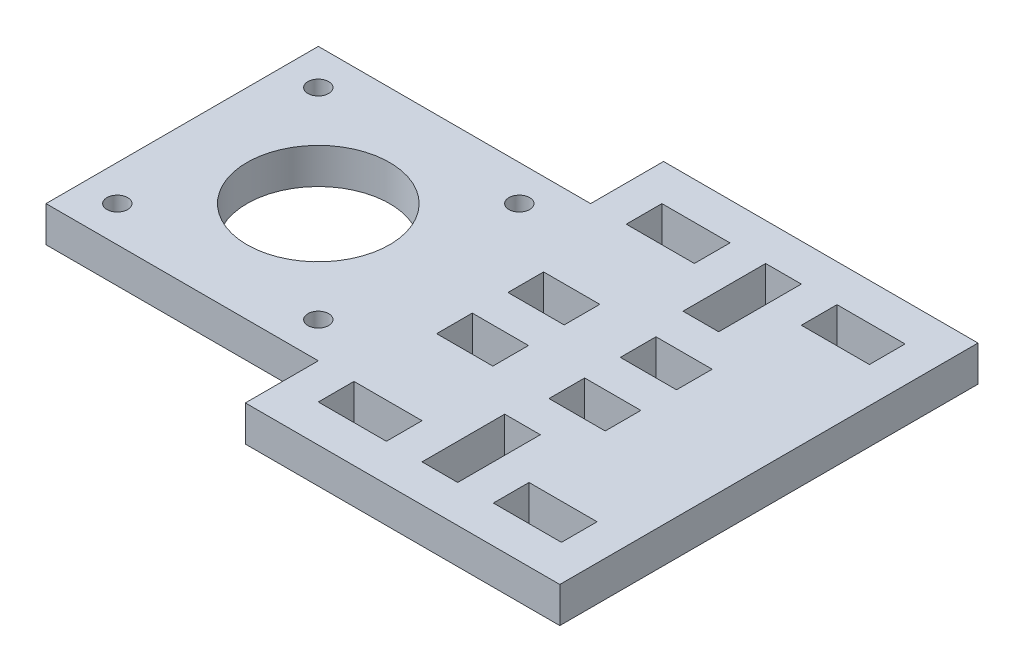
from build123d import *

# Parameters (mm, degrees)
SKETCH1_R           = 11
SKETCH1_R_2         = 1.6
SKETCH1_W           = 10.5
SKETCH1_H           = 5.5
SKETCH1_W_2         = 5.5
SKETCH1_H_2         = 12.75
SKETCH1_W_3         = 8.666666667
BOSS_EXTRUDE1_DEPTH = 5.5


with BuildPart() as part:
    # Sketch1 → Boss-Extrude1 (new body)
    with BuildSketch(Plane(origin=(0, 0, 0), x_dir=(1, 0, 0), z_dir=(0, 1, 0))):
        Polygon((-48.500000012, 64.5), (0, 64.5), (0, 0), (-48.500000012, 0), (-48.500000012, 11.25), (-90.500000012, 11.25), (-90.500000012, 53.25), (-48.500000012, 53.25), align=None)
        with Locations(Location((-69.500000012, 32.25, 0), (0, 0, 270))):
            Circle(SKETCH1_R, mode=Mode.SUBTRACT)
        with Locations(Location((-85, 47.749999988, 0), (0, 0, 270))):
            Circle(SKETCH1_R_2, mode=Mode.SUBTRACT)
        with Locations(Location((-54.000000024, 47.749999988, 0), (0, 0, 270))):
            Circle(SKETCH1_R_2, mode=Mode.SUBTRACT)
        with Locations(Location((-85, 16.750000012, 0), (0, 0, 270))):
            Circle(SKETCH1_R_2, mode=Mode.SUBTRACT)
        with Locations(Location((-54.000000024, 16.750000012, 0), (0, 0, 270))):
            Circle(SKETCH1_R_2, mode=Mode.SUBTRACT)
        with Locations((-10.75, 8.5)):
            Rectangle(SKETCH1_W, SKETCH1_H, mode=Mode.SUBTRACT)
        with Locations((-37.75, 56)):
            Rectangle(SKETCH1_W, SKETCH1_H, mode=Mode.SUBTRACT)
        with Locations((-24.25, 52.375)):
            Rectangle(SKETCH1_W_2, SKETCH1_H_2, mode=Mode.SUBTRACT)
        with Locations((-10.75, 56)):
            Rectangle(SKETCH1_W, SKETCH1_H, mode=Mode.SUBTRACT)
        with Locations((-38.666666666, 37.75)):
            Rectangle(SKETCH1_W_3, SKETCH1_H, mode=Mode.SUBTRACT)
        with Locations((-21.333333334, 37.75)):
            Rectangle(SKETCH1_W_3, SKETCH1_H, mode=Mode.SUBTRACT)
        with Locations((-38.666666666, 26.75)):
            Rectangle(SKETCH1_W_3, SKETCH1_H, mode=Mode.SUBTRACT)
        with Locations((-21.333333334, 26.75)):
            Rectangle(SKETCH1_W_3, SKETCH1_H, mode=Mode.SUBTRACT)
        with Locations((-37.75, 8.5)):
            Rectangle(SKETCH1_W, SKETCH1_H, mode=Mode.SUBTRACT)
        with Locations((-24.25, 12.125)):
            Rectangle(SKETCH1_W_2, SKETCH1_H_2, mode=Mode.SUBTRACT)
    extrude(amount=BOSS_EXTRUDE1_DEPTH)


solid = part.part
